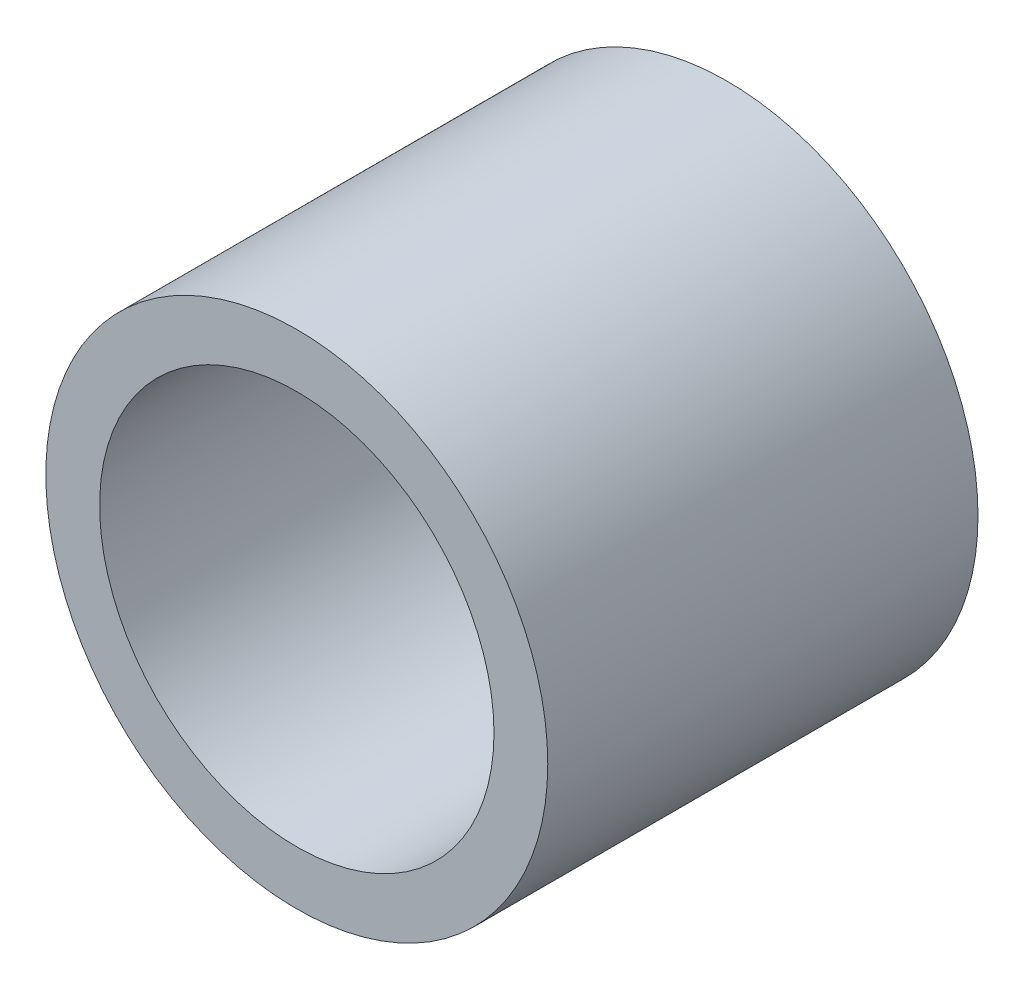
from build123d import *

# Parameters (mm, degrees)
ESQUISSE1_R          = 14
ESQUISSE1_R_2        = 11
BASE_EXTRUSION_DEPTH = 24


with BuildPart() as part:
    # Esquisse1 → Base-Extrusion (new body)
    with BuildSketch(Plane.XY):
        Circle(ESQUISSE1_R)
        Circle(ESQUISSE1_R_2, mode=Mode.SUBTRACT)
    extrude(amount=-BASE_EXTRUSION_DEPTH)


solid = part.part
